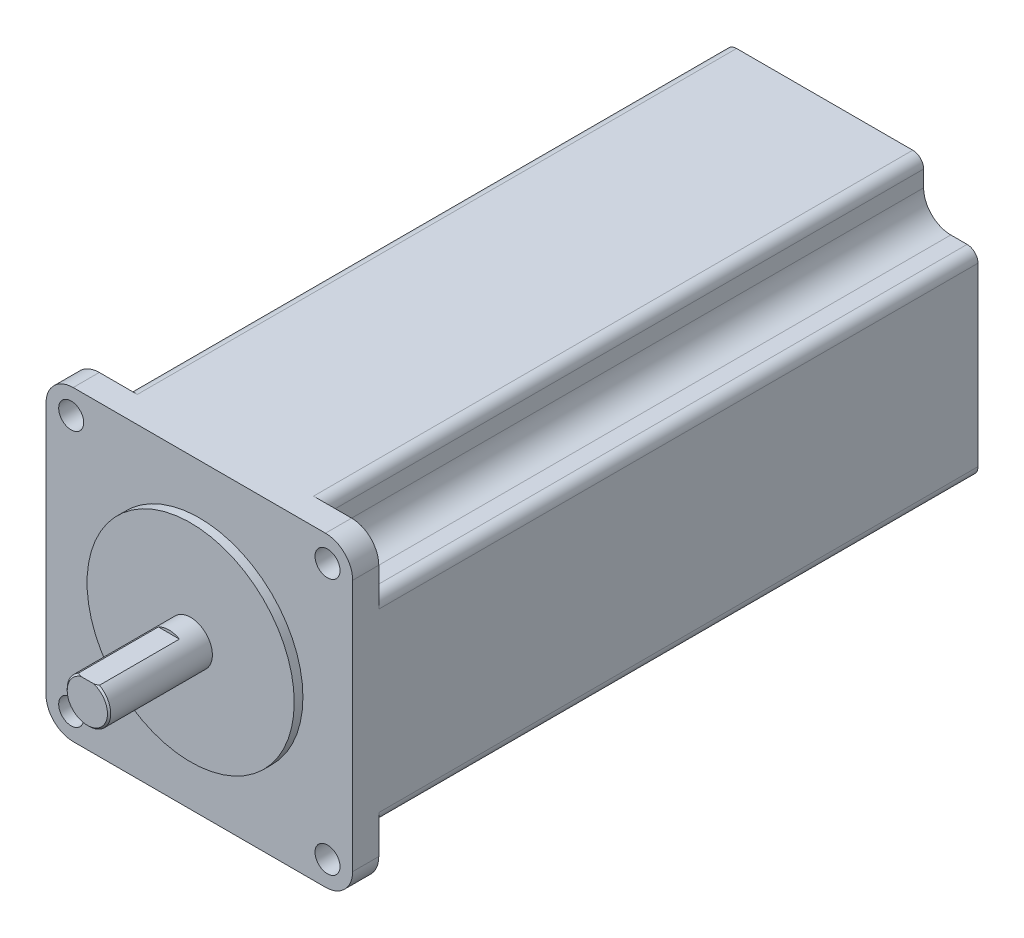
ISO-10303-21;
HEADER;
FILE_DESCRIPTION(('STEP AP214'),'2;1');
FILE_NAME('part.step','',(''),(''),'','','');
FILE_SCHEMA(('AUTOMOTIVE_DESIGN { 1 0 10303 214 1 1 1 1 }'));
ENDSEC;
DATA;
#1=APPLICATION_CONTEXT('core data for automotive mechanical design processes');
#2=APPLICATION_PROTOCOL_DEFINITION('international standard','automotive_design',2000,#1);
#3=PRODUCT_CONTEXT('',#1,'mechanical');
#4=PRODUCT('Part','Part','',(#3));
#5=PRODUCT_RELATED_PRODUCT_CATEGORY('part','',(#4));
#6=PRODUCT_DEFINITION_FORMATION('','',#4);
#7=PRODUCT_DEFINITION_CONTEXT('part definition',#1,'design');
#8=PRODUCT_DEFINITION('design','',#6,#7);
#9=PRODUCT_DEFINITION_SHAPE('','',#8);
#10=(LENGTH_UNIT() NAMED_UNIT(*) SI_UNIT(.MILLI.,.METRE.));
#11=(NAMED_UNIT(*) PLANE_ANGLE_UNIT() SI_UNIT($,.RADIAN.));
#12=(NAMED_UNIT(*) SI_UNIT($,.STERADIAN.) SOLID_ANGLE_UNIT());
#13=UNCERTAINTY_MEASURE_WITH_UNIT(LENGTH_MEASURE(1.E-05),#10,'distance_accuracy_value','');
#14=(GEOMETRIC_REPRESENTATION_CONTEXT(3) GLOBAL_UNCERTAINTY_ASSIGNED_CONTEXT((#13)) GLOBAL_UNIT_ASSIGNED_CONTEXT((#10,
#11,#12)) REPRESENTATION_CONTEXT('',''));
#15=CARTESIAN_POINT('',(0.,0.,0.));
#16=DIRECTION('',(0.,0.,1.));
#17=DIRECTION('',(1.,0.,0.));
#18=AXIS2_PLACEMENT_3D('',#15,#16,#17);
#19=CARTESIAN_POINT('',(23.2,-23.2,-116.6));
#20=DIRECTION('',(0.,0.,1.));
#21=DIRECTION('',(1.,0.,0.));
#22=AXIS2_PLACEMENT_3D('',#19,#20,#21);
#23=CYLINDRICAL_SURFACE('',#22,5.);
#24=CARTESIAN_POINT('',(23.2,-23.2,-6.4));
#25=DIRECTION('',(0.,0.,-1.));
#26=DIRECTION('',(-1.,0.,0.));
#27=AXIS2_PLACEMENT_3D('',#24,#25,#26);
#28=CIRCLE('',#27,5.);
#29=CARTESIAN_POINT('',(28.2,-23.2,-6.4));
#30=VERTEX_POINT('',#29);
#31=CARTESIAN_POINT('',(23.2,-28.2,-6.4));
#32=VERTEX_POINT('',#31);
#33=EDGE_CURVE('E335',#30,#32,#28,.T.);
#34=ORIENTED_EDGE('',*,*,#33,.F.);
#35=DIRECTION('',(0.,0.,1.));
#36=VECTOR('',#35,1.);
#37=CARTESIAN_POINT('',(28.2,-23.2,-116.6));
#38=LINE('',#37,#36);
#39=CARTESIAN_POINT('',(28.2,-23.2,-1.6));
#40=VERTEX_POINT('',#39);
#41=EDGE_CURVE('E502',#30,#40,#38,.T.);
#42=ORIENTED_EDGE('',*,*,#41,.T.);
#43=CARTESIAN_POINT('',(23.2,-23.2,-1.6));
#44=DIRECTION('',(0.,0.,-1.));
#45=DIRECTION('',(1.,0.,0.));
#46=AXIS2_PLACEMENT_3D('',#43,#44,#45);
#47=CIRCLE('',#46,5.);
#48=CARTESIAN_POINT('',(23.2,-28.2,-1.6));
#49=VERTEX_POINT('',#48);
#50=EDGE_CURVE('E492',#40,#49,#47,.T.);
#51=ORIENTED_EDGE('',*,*,#50,.T.);
#52=DIRECTION('',(0.,0.,1.));
#53=VECTOR('',#52,1.);
#54=CARTESIAN_POINT('',(23.2,-28.2,-116.6));
#55=LINE('',#54,#53);
#56=EDGE_CURVE('E538',#32,#49,#55,.T.);
#57=ORIENTED_EDGE('',*,*,#56,.F.);
#58=EDGE_LOOP('',(#34,#42,#51,#57));
#59=FACE_BOUND('',#58,.T.);
#60=ADVANCED_FACE('F35',(#59),#23,.T.);
#61=CARTESIAN_POINT('',(-23.2,-23.2,-116.6));
#62=DIRECTION('',(0.,0.,1.));
#63=DIRECTION('',(1.,0.,0.));
#64=AXIS2_PLACEMENT_3D('',#61,#62,#63);
#65=CYLINDRICAL_SURFACE('',#64,5.);
#66=CARTESIAN_POINT('',(-23.2,-23.2,-6.4));
#67=DIRECTION('',(0.,0.,-1.));
#68=DIRECTION('',(-1.,0.,0.));
#69=AXIS2_PLACEMENT_3D('',#66,#67,#68);
#70=CIRCLE('',#69,5.);
#71=CARTESIAN_POINT('',(-23.2,-28.2,-6.4));
#72=VERTEX_POINT('',#71);
#73=CARTESIAN_POINT('',(-28.2,-23.2,-6.4));
#74=VERTEX_POINT('',#73);
#75=EDGE_CURVE('E382',#72,#74,#70,.T.);
#76=ORIENTED_EDGE('',*,*,#75,.F.);
#77=DIRECTION('',(0.,0.,1.));
#78=VECTOR('',#77,1.);
#79=CARTESIAN_POINT('',(-23.2,-28.2,-116.6));
#80=LINE('',#79,#78);
#81=CARTESIAN_POINT('',(-23.2,-28.2,-1.6));
#82=VERTEX_POINT('',#81);
#83=EDGE_CURVE('E536',#72,#82,#80,.T.);
#84=ORIENTED_EDGE('',*,*,#83,.T.);
#85=CARTESIAN_POINT('',(-23.2,-23.2,-1.6));
#86=DIRECTION('',(0.,0.,-1.));
#87=DIRECTION('',(1.,0.,0.));
#88=AXIS2_PLACEMENT_3D('',#85,#86,#87);
#89=CIRCLE('',#88,5.);
#90=CARTESIAN_POINT('',(-28.2,-23.2,-1.6));
#91=VERTEX_POINT('',#90);
#92=EDGE_CURVE('E508',#82,#91,#89,.T.);
#93=ORIENTED_EDGE('',*,*,#92,.T.);
#94=DIRECTION('',(0.,0.,1.));
#95=VECTOR('',#94,1.);
#96=CARTESIAN_POINT('',(-28.2,-23.2,-116.6));
#97=LINE('',#96,#95);
#98=EDGE_CURVE('E534',#74,#91,#97,.T.);
#99=ORIENTED_EDGE('',*,*,#98,.F.);
#100=EDGE_LOOP('',(#76,#84,#93,#99));
#101=FACE_BOUND('',#100,.T.);
#102=ADVANCED_FACE('F586',(#101),#65,.T.);
#103=CARTESIAN_POINT('',(23.2,23.2,-116.6));
#104=DIRECTION('',(0.,0.,1.));
#105=DIRECTION('',(1.,0.,0.));
#106=AXIS2_PLACEMENT_3D('',#103,#104,#105);
#107=CYLINDRICAL_SURFACE('',#106,5.);
#108=CARTESIAN_POINT('',(23.2,23.2,-6.4));
#109=DIRECTION('',(0.,0.,-1.));
#110=DIRECTION('',(-1.,0.,0.));
#111=AXIS2_PLACEMENT_3D('',#108,#109,#110);
#112=CIRCLE('',#111,5.);
#113=CARTESIAN_POINT('',(23.2,28.2,-6.4));
#114=VERTEX_POINT('',#113);
#115=CARTESIAN_POINT('',(28.2,23.2,-6.4));
#116=VERTEX_POINT('',#115);
#117=EDGE_CURVE('E429',#114,#116,#112,.T.);
#118=ORIENTED_EDGE('',*,*,#117,.F.);
#119=DIRECTION('',(0.,0.,1.));
#120=VECTOR('',#119,1.);
#121=CARTESIAN_POINT('',(23.2,28.2,-116.6));
#122=LINE('',#121,#120);
#123=CARTESIAN_POINT('',(23.2,28.2,-1.6));
#124=VERTEX_POINT('',#123);
#125=EDGE_CURVE('E528',#114,#124,#122,.T.);
#126=ORIENTED_EDGE('',*,*,#125,.T.);
#127=CARTESIAN_POINT('',(23.2,23.2,-1.6));
#128=DIRECTION('',(0.,0.,-1.));
#129=DIRECTION('',(1.,0.,0.));
#130=AXIS2_PLACEMENT_3D('',#127,#128,#129);
#131=CIRCLE('',#130,5.);
#132=CARTESIAN_POINT('',(28.2,23.2,-1.6));
#133=VERTEX_POINT('',#132);
#134=EDGE_CURVE('E520',#124,#133,#131,.T.);
#135=ORIENTED_EDGE('',*,*,#134,.T.);
#136=DIRECTION('',(0.,0.,1.));
#137=VECTOR('',#136,1.);
#138=CARTESIAN_POINT('',(28.2,23.2,-116.6));
#139=LINE('',#138,#137);
#140=EDGE_CURVE('E526',#116,#133,#139,.T.);
#141=ORIENTED_EDGE('',*,*,#140,.F.);
#142=EDGE_LOOP('',(#118,#126,#135,#141));
#143=FACE_BOUND('',#142,.T.);
#144=ADVANCED_FACE('F591',(#143),#107,.T.);
#145=CARTESIAN_POINT('',(0.,0.,0.));
#146=DIRECTION('',(0.,0.,1.));
#147=DIRECTION('',(1.,0.,0.));
#148=AXIS2_PLACEMENT_3D('',#145,#146,#147);
#149=PLANE('',#148);
#150=CARTESIAN_POINT('',(0.,0.,0.));
#151=DIRECTION('',(0.,0.,1.));
#152=DIRECTION('',(1.,0.,0.));
#153=AXIS2_PLACEMENT_3D('',#150,#151,#152);
#154=CIRCLE('',#153,19.05);
#155=CARTESIAN_POINT('',(19.05,0.,0.));
#156=VERTEX_POINT('',#155);
#157=EDGE_CURVE('E546',#156,#156,#154,.T.);
#158=ORIENTED_EDGE('',*,*,#157,.T.);
#159=EDGE_LOOP('',(#158));
#160=FACE_BOUND('',#159,.T.);
#161=CARTESIAN_POINT('',(0.,0.,0.));
#162=DIRECTION('',(0.,0.,1.));
#163=DIRECTION('',(1.,0.,0.));
#164=AXIS2_PLACEMENT_3D('',#161,#162,#163);
#165=CIRCLE('',#164,4.);
#166=CARTESIAN_POINT('',(4.,0.,0.));
#167=VERTEX_POINT('',#166);
#168=EDGE_CURVE('E543',#167,#167,#165,.T.);
#169=ORIENTED_EDGE('',*,*,#168,.F.);
#170=EDGE_LOOP('',(#169));
#171=FACE_BOUND('',#170,.T.);
#172=ADVANCED_FACE('F610',(#160,#171),#149,.T.);
#173=CARTESIAN_POINT('',(0.,0.,-1.6));
#174=DIRECTION('',(0.,0.,1.));
#175=DIRECTION('',(1.,0.,0.));
#176=AXIS2_PLACEMENT_3D('',#173,#174,#175);
#177=CYLINDRICAL_SURFACE('',#176,19.05);
#178=CARTESIAN_POINT('',(0.,0.,-1.6));
#179=DIRECTION('',(0.,0.,1.));
#180=DIRECTION('',(1.,0.,0.));
#181=AXIS2_PLACEMENT_3D('',#178,#179,#180);
#182=CIRCLE('',#181,19.05);
#183=CARTESIAN_POINT('',(19.05,0.,-1.6));
#184=VERTEX_POINT('',#183);
#185=EDGE_CURVE('E540',#184,#184,#182,.F.);
#186=ORIENTED_EDGE('',*,*,#185,.F.);
#187=EDGE_LOOP('',(#186));
#188=FACE_BOUND('',#187,.T.);
#189=ORIENTED_EDGE('',*,*,#157,.F.);
#190=EDGE_LOOP('',(#189));
#191=FACE_BOUND('',#190,.T.);
#192=ADVANCED_FACE('F582',(#188,#191),#177,.T.);
#193=CARTESIAN_POINT('',(0.,0.,19.));
#194=DIRECTION('',(0.,0.,-1.));
#195=DIRECTION('',(-1.,0.,0.));
#196=AXIS2_PLACEMENT_3D('',#193,#194,#195);
#197=CYLINDRICAL_SURFACE('',#196,4.);
#198=CARTESIAN_POINT('',(0.,0.,18.7));
#199=DIRECTION('',(0.,0.,1.));
#200=DIRECTION('',(1.,0.,0.));
#201=AXIS2_PLACEMENT_3D('',#198,#199,#200);
#202=CIRCLE('',#201,4.);
#203=CARTESIAN_POINT('',(1.93649167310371,3.5,18.7));
#204=VERTEX_POINT('',#203);
#205=CARTESIAN_POINT('',(-1.93649167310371,3.5,18.7));
#206=VERTEX_POINT('',#205);
#207=EDGE_CURVE('E283',#204,#206,#202,.F.);
#208=ORIENTED_EDGE('',*,*,#207,.T.);
#209=DIRECTION('',(0.,0.,1.));
#210=VECTOR('',#209,1.);
#211=CARTESIAN_POINT('',(-1.93649167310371,3.5,4.));
#212=LINE('',#211,#210);
#213=CARTESIAN_POINT('',(-1.93649167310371,3.5,4.));
#214=VERTEX_POINT('',#213);
#215=EDGE_CURVE('E275',#214,#206,#212,.T.);
#216=ORIENTED_EDGE('',*,*,#215,.F.);
#217=CARTESIAN_POINT('',(0.,0.,4.));
#218=DIRECTION('',(0.,0.,1.));
#219=DIRECTION('',(1.,0.,0.));
#220=AXIS2_PLACEMENT_3D('',#217,#218,#219);
#221=CIRCLE('',#220,4.);
#222=CARTESIAN_POINT('',(1.93649167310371,3.5,4.));
#223=VERTEX_POINT('',#222);
#224=EDGE_CURVE('E266',#223,#214,#221,.T.);
#225=ORIENTED_EDGE('',*,*,#224,.F.);
#226=DIRECTION('',(0.,0.,1.));
#227=VECTOR('',#226,1.);
#228=CARTESIAN_POINT('',(1.93649167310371,3.5,4.));
#229=LINE('',#228,#227);
#230=EDGE_CURVE('E277',#223,#204,#229,.T.);
#231=ORIENTED_EDGE('',*,*,#230,.T.);
#232=EDGE_LOOP('',(#208,#216,#225,#231));
#233=FACE_BOUND('',#232,.T.);
#234=ORIENTED_EDGE('',*,*,#168,.T.);
#235=EDGE_LOOP('',(#234));
#236=FACE_BOUND('',#235,.T.);
#237=ADVANCED_FACE('F280',(#233,#236),#197,.T.);
#238=CARTESIAN_POINT('',(0.,0.,19.));
#239=DIRECTION('',(0.,0.,1.));
#240=DIRECTION('',(1.,0.,0.));
#241=AXIS2_PLACEMENT_3D('',#238,#239,#240);
#242=PLANE('',#241);
#243=DIRECTION('',(1.,0.,0.));
#244=VECTOR('',#243,1.);
#245=CARTESIAN_POINT('',(-1.93649167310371,3.5,19.));
#246=LINE('',#245,#244);
#247=CARTESIAN_POINT('',(-1.20000000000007,3.5,19.));
#248=VERTEX_POINT('',#247);
#249=CARTESIAN_POINT('',(1.20000000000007,3.5,19.));
#250=VERTEX_POINT('',#249);
#251=EDGE_CURVE('E54',#248,#250,#246,.T.);
#252=ORIENTED_EDGE('',*,*,#251,.F.);
#253=CARTESIAN_POINT('',(0.,0.,19.));
#254=DIRECTION('',(0.,0.,1.));
#255=DIRECTION('',(1.,0.,0.));
#256=AXIS2_PLACEMENT_3D('',#253,#254,#255);
#257=CIRCLE('',#256,3.70000000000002);
#258=EDGE_CURVE('E558',#248,#250,#257,.T.);
#259=ORIENTED_EDGE('',*,*,#258,.T.);
#260=EDGE_LOOP('',(#252,#259));
#261=FACE_BOUND('',#260,.T.);
#262=ADVANCED_FACE('F571',(#261),#242,.T.);
#263=CARTESIAN_POINT('',(-23.2,-28.2,-116.6));
#264=DIRECTION('',(0.,1.,0.));
#265=DIRECTION('',(-1.,0.,0.));
#266=AXIS2_PLACEMENT_3D('',#263,#264,#265);
#267=PLANE('',#266);
#268=DIRECTION('',(0.,0.,-1.));
#269=VECTOR('',#268,1.);
#270=CARTESIAN_POINT('',(-16.2,-28.2,-6.4));
#271=LINE('',#270,#269);
#272=CARTESIAN_POINT('',(-16.2,-28.2,-6.4));
#273=VERTEX_POINT('',#272);
#274=CARTESIAN_POINT('',(-16.2,-28.2,-116.6));
#275=VERTEX_POINT('',#274);
#276=EDGE_CURVE('E366',#273,#275,#271,.T.);
#277=ORIENTED_EDGE('',*,*,#276,.T.);
#278=DIRECTION('',(-1.,0.,0.));
#279=VECTOR('',#278,1.);
#280=CARTESIAN_POINT('',(-23.2,-28.2,-116.6));
#281=LINE('',#280,#279);
#282=CARTESIAN_POINT('',(16.2,-28.2,-116.6));
#283=VERTEX_POINT('',#282);
#284=EDGE_CURVE('E493',#283,#275,#281,.T.);
#285=ORIENTED_EDGE('',*,*,#284,.F.);
#286=DIRECTION('',(0.,0.,-1.));
#287=VECTOR('',#286,1.);
#288=CARTESIAN_POINT('',(16.2,-28.2,-6.4));
#289=LINE('',#288,#287);
#290=CARTESIAN_POINT('',(16.2,-28.2,-6.4));
#291=VERTEX_POINT('',#290);
#292=EDGE_CURVE('E338',#291,#283,#289,.T.);
#293=ORIENTED_EDGE('',*,*,#292,.F.);
#294=DIRECTION('',(-1.,0.,0.));
#295=VECTOR('',#294,1.);
#296=CARTESIAN_POINT('',(-23.2,-28.2,-6.4));
#297=LINE('',#296,#295);
#298=EDGE_CURVE('E347',#32,#291,#297,.T.);
#299=ORIENTED_EDGE('',*,*,#298,.F.);
#300=ORIENTED_EDGE('',*,*,#56,.T.);
#301=DIRECTION('',(-1.,0.,0.));
#302=VECTOR('',#301,1.);
#303=CARTESIAN_POINT('',(-23.2,-28.2,-1.6));
#304=LINE('',#303,#302);
#305=EDGE_CURVE('E505',#49,#82,#304,.T.);
#306=ORIENTED_EDGE('',*,*,#305,.T.);
#307=ORIENTED_EDGE('',*,*,#83,.F.);
#308=DIRECTION('',(-1.,0.,0.));
#309=VECTOR('',#308,1.);
#310=CARTESIAN_POINT('',(-23.2,-28.2,-6.4));
#311=LINE('',#310,#309);
#312=EDGE_CURVE('E394',#273,#72,#311,.T.);
#313=ORIENTED_EDGE('',*,*,#312,.F.);
#314=EDGE_LOOP('',(#277,#285,#293,#299,#300,#306,#307,#313));
#315=FACE_BOUND('',#314,.T.);
#316=ADVANCED_FACE('F573',(#315),#267,.F.);
#317=CARTESIAN_POINT('',(-28.2,23.2,-116.6));
#318=DIRECTION('',(1.,0.,0.));
#319=DIRECTION('',(0.,1.,0.));
#320=AXIS2_PLACEMENT_3D('',#317,#318,#319);
#321=PLANE('',#320);
#322=DIRECTION('',(0.,0.,-1.));
#323=VECTOR('',#322,1.);
#324=CARTESIAN_POINT('',(-28.2,16.2,-6.4));
#325=LINE('',#324,#323);
#326=CARTESIAN_POINT('',(-28.2,16.2,-6.4));
#327=VERTEX_POINT('',#326);
#328=CARTESIAN_POINT('',(-28.2,16.2,-116.6));
#329=VERTEX_POINT('',#328);
#330=EDGE_CURVE('E474',#327,#329,#325,.T.);
#331=ORIENTED_EDGE('',*,*,#330,.T.);
#332=DIRECTION('',(0.,1.,0.));
#333=VECTOR('',#332,1.);
#334=CARTESIAN_POINT('',(-28.2,23.2,-116.6));
#335=LINE('',#334,#333);
#336=CARTESIAN_POINT('',(-28.2,-16.2,-116.6));
#337=VERTEX_POINT('',#336);
#338=EDGE_CURVE('E495',#337,#329,#335,.T.);
#339=ORIENTED_EDGE('',*,*,#338,.F.);
#340=DIRECTION('',(0.,0.,-1.));
#341=VECTOR('',#340,1.);
#342=CARTESIAN_POINT('',(-28.2,-16.2,-6.4));
#343=LINE('',#342,#341);
#344=CARTESIAN_POINT('',(-28.2,-16.2,-6.4));
#345=VERTEX_POINT('',#344);
#346=EDGE_CURVE('E389',#345,#337,#343,.T.);
#347=ORIENTED_EDGE('',*,*,#346,.F.);
#348=DIRECTION('',(0.,1.,0.));
#349=VECTOR('',#348,1.);
#350=CARTESIAN_POINT('',(-28.2,23.2,-6.4));
#351=LINE('',#350,#349);
#352=EDGE_CURVE('E554',#74,#345,#351,.T.);
#353=ORIENTED_EDGE('',*,*,#352,.F.);
#354=ORIENTED_EDGE('',*,*,#98,.T.);
#355=DIRECTION('',(0.,1.,0.));
#356=VECTOR('',#355,1.);
#357=CARTESIAN_POINT('',(-28.2,23.2,-1.6));
#358=LINE('',#357,#356);
#359=CARTESIAN_POINT('',(-28.2,23.2,-1.6));
#360=VERTEX_POINT('',#359);
#361=EDGE_CURVE('E511',#91,#360,#358,.T.);
#362=ORIENTED_EDGE('',*,*,#361,.T.);
#363=DIRECTION('',(0.,0.,1.));
#364=VECTOR('',#363,1.);
#365=CARTESIAN_POINT('',(-28.2,23.2,-116.6));
#366=LINE('',#365,#364);
#367=CARTESIAN_POINT('',(-28.2,23.2,-6.4));
#368=VERTEX_POINT('',#367);
#369=EDGE_CURVE('E532',#368,#360,#366,.T.);
#370=ORIENTED_EDGE('',*,*,#369,.F.);
#371=DIRECTION('',(0.,-1.,0.));
#372=VECTOR('',#371,1.);
#373=CARTESIAN_POINT('',(-28.2,23.2,-6.4));
#374=LINE('',#373,#372);
#375=EDGE_CURVE('E489',#368,#327,#374,.T.);
#376=ORIENTED_EDGE('',*,*,#375,.T.);
#377=EDGE_LOOP('',(#331,#339,#347,#353,#354,#362,#370,#376));
#378=FACE_BOUND('',#377,.T.);
#379=ADVANCED_FACE('F579',(#378),#321,.F.);
#380=CARTESIAN_POINT('',(-23.2,23.2,-116.6));
#381=DIRECTION('',(0.,0.,1.));
#382=DIRECTION('',(1.,0.,0.));
#383=AXIS2_PLACEMENT_3D('',#380,#381,#382);
#384=CYLINDRICAL_SURFACE('',#383,5.);
#385=DIRECTION('',(0.,0.,1.));
#386=VECTOR('',#385,1.);
#387=CARTESIAN_POINT('',(-23.2,28.2,-116.6));
#388=LINE('',#387,#386);
#389=CARTESIAN_POINT('',(-23.2,28.2,-6.4));
#390=VERTEX_POINT('',#389);
#391=CARTESIAN_POINT('',(-23.2,28.2,-1.6));
#392=VERTEX_POINT('',#391);
#393=EDGE_CURVE('E530',#390,#392,#388,.T.);
#394=ORIENTED_EDGE('',*,*,#393,.F.);
#395=CARTESIAN_POINT('',(-23.2,23.2,-6.4));
#396=DIRECTION('',(0.,0.,1.));
#397=DIRECTION('',(1.,0.,0.));
#398=AXIS2_PLACEMENT_3D('',#395,#396,#397);
#399=CIRCLE('',#398,5.);
#400=EDGE_CURVE('E477',#390,#368,#399,.T.);
#401=ORIENTED_EDGE('',*,*,#400,.T.);
#402=ORIENTED_EDGE('',*,*,#369,.T.);
#403=CARTESIAN_POINT('',(-23.2,23.2,-1.6));
#404=DIRECTION('',(0.,0.,-1.));
#405=DIRECTION('',(1.,0.,0.));
#406=AXIS2_PLACEMENT_3D('',#403,#404,#405);
#407=CIRCLE('',#406,5.);
#408=EDGE_CURVE('E514',#360,#392,#407,.T.);
#409=ORIENTED_EDGE('',*,*,#408,.T.);
#410=EDGE_LOOP('',(#394,#401,#402,#409));
#411=FACE_BOUND('',#410,.T.);
#412=ADVANCED_FACE('F598',(#411),#384,.T.);
#413=CARTESIAN_POINT('',(23.2,28.2,-116.6));
#414=DIRECTION('',(0.,-1.,0.));
#415=DIRECTION('',(1.,0.,0.));
#416=AXIS2_PLACEMENT_3D('',#413,#414,#415);
#417=PLANE('',#416);
#418=DIRECTION('',(0.,0.,-1.));
#419=VECTOR('',#418,1.);
#420=CARTESIAN_POINT('',(16.2,28.2,-6.4));
#421=LINE('',#420,#419);
#422=CARTESIAN_POINT('',(16.2,28.2,-6.4));
#423=VERTEX_POINT('',#422);
#424=CARTESIAN_POINT('',(16.2,28.2,-116.6));
#425=VERTEX_POINT('',#424);
#426=EDGE_CURVE('E413',#423,#425,#421,.T.);
#427=ORIENTED_EDGE('',*,*,#426,.T.);
#428=DIRECTION('',(1.,0.,0.));
#429=VECTOR('',#428,1.);
#430=CARTESIAN_POINT('',(0.,28.2,-116.6));
#431=LINE('',#430,#429);
#432=CARTESIAN_POINT('',(-16.2,28.2,-116.6));
#433=VERTEX_POINT('',#432);
#434=EDGE_CURVE('E498',#433,#425,#431,.T.);
#435=ORIENTED_EDGE('',*,*,#434,.F.);
#436=DIRECTION('',(0.,0.,-1.));
#437=VECTOR('',#436,1.);
#438=CARTESIAN_POINT('',(-16.2,28.2,-6.4));
#439=LINE('',#438,#437);
#440=CARTESIAN_POINT('',(-16.2,28.2,-6.4));
#441=VERTEX_POINT('',#440);
#442=EDGE_CURVE('E460',#441,#433,#439,.T.);
#443=ORIENTED_EDGE('',*,*,#442,.F.);
#444=DIRECTION('',(-1.,0.,0.));
#445=VECTOR('',#444,1.);
#446=CARTESIAN_POINT('',(23.2,28.2,-6.4));
#447=LINE('',#446,#445);
#448=EDGE_CURVE('E549',#441,#390,#447,.T.);
#449=ORIENTED_EDGE('',*,*,#448,.T.);
#450=ORIENTED_EDGE('',*,*,#393,.T.);
#451=DIRECTION('',(1.,0.,0.));
#452=VECTOR('',#451,1.);
#453=CARTESIAN_POINT('',(23.2,28.2,-1.6));
#454=LINE('',#453,#452);
#455=EDGE_CURVE('E517',#392,#124,#454,.T.);
#456=ORIENTED_EDGE('',*,*,#455,.T.);
#457=ORIENTED_EDGE('',*,*,#125,.F.);
#458=DIRECTION('',(1.,0.,0.));
#459=VECTOR('',#458,1.);
#460=CARTESIAN_POINT('',(23.2,28.2,-6.4));
#461=LINE('',#460,#459);
#462=EDGE_CURVE('E441',#423,#114,#461,.T.);
#463=ORIENTED_EDGE('',*,*,#462,.F.);
#464=EDGE_LOOP('',(#427,#435,#443,#449,#450,#456,#457,#463));
#465=FACE_BOUND('',#464,.T.);
#466=ADVANCED_FACE('F602',(#465),#417,.F.);
#467=CARTESIAN_POINT('',(28.2,-23.2,-116.6));
#468=DIRECTION('',(-1.,0.,0.));
#469=DIRECTION('',(0.,0.,1.));
#470=AXIS2_PLACEMENT_3D('',#467,#468,#469);
#471=PLANE('',#470);
#472=DIRECTION('',(0.,0.,-1.));
#473=VECTOR('',#472,1.);
#474=CARTESIAN_POINT('',(28.2,-16.2,-6.4));
#475=LINE('',#474,#473);
#476=CARTESIAN_POINT('',(28.2,-16.2,-6.4));
#477=VERTEX_POINT('',#476);
#478=CARTESIAN_POINT('',(28.2,-16.2,-116.6));
#479=VERTEX_POINT('',#478);
#480=EDGE_CURVE('E340',#477,#479,#475,.T.);
#481=ORIENTED_EDGE('',*,*,#480,.T.);
#482=DIRECTION('',(0.,-1.,0.));
#483=VECTOR('',#482,1.);
#484=CARTESIAN_POINT('',(28.2,-23.2,-116.6));
#485=LINE('',#484,#483);
#486=CARTESIAN_POINT('',(28.2,16.2,-116.6));
#487=VERTEX_POINT('',#486);
#488=EDGE_CURVE('E500',#487,#479,#485,.T.);
#489=ORIENTED_EDGE('',*,*,#488,.F.);
#490=DIRECTION('',(0.,0.,-1.));
#491=VECTOR('',#490,1.);
#492=CARTESIAN_POINT('',(28.2,16.2,-6.4));
#493=LINE('',#492,#491);
#494=CARTESIAN_POINT('',(28.2,16.2,-6.4));
#495=VERTEX_POINT('',#494);
#496=EDGE_CURVE('E436',#495,#487,#493,.T.);
#497=ORIENTED_EDGE('',*,*,#496,.F.);
#498=DIRECTION('',(0.,-1.,0.));
#499=VECTOR('',#498,1.);
#500=CARTESIAN_POINT('',(28.2,-23.2,-6.4));
#501=LINE('',#500,#499);
#502=EDGE_CURVE('E552',#116,#495,#501,.T.);
#503=ORIENTED_EDGE('',*,*,#502,.F.);
#504=ORIENTED_EDGE('',*,*,#140,.T.);
#505=DIRECTION('',(0.,-1.,0.));
#506=VECTOR('',#505,1.);
#507=CARTESIAN_POINT('',(28.2,-23.2,-1.6));
#508=LINE('',#507,#506);
#509=EDGE_CURVE('E496',#133,#40,#508,.T.);
#510=ORIENTED_EDGE('',*,*,#509,.T.);
#511=ORIENTED_EDGE('',*,*,#41,.F.);
#512=DIRECTION('',(0.,-1.,0.));
#513=VECTOR('',#512,1.);
#514=CARTESIAN_POINT('',(28.2,-23.2,-6.4));
#515=LINE('',#514,#513);
#516=EDGE_CURVE('E556',#477,#30,#515,.T.);
#517=ORIENTED_EDGE('',*,*,#516,.F.);
#518=EDGE_LOOP('',(#481,#489,#497,#503,#504,#510,#511,#517));
#519=FACE_BOUND('',#518,.T.);
#520=ADVANCED_FACE('F606',(#519),#471,.F.);
#521=CARTESIAN_POINT('',(23.2,-23.2,-116.6));
#522=DIRECTION('',(0.,0.,1.));
#523=DIRECTION('',(1.,0.,0.));
#524=AXIS2_PLACEMENT_3D('',#521,#522,#523);
#525=PLANE('',#524);
#526=DIRECTION('',(0.,1.,0.));
#527=VECTOR('',#526,1.);
#528=CARTESIAN_POINT('',(18.2,-26.2,-116.6));
#529=LINE('',#528,#527);
#530=CARTESIAN_POINT('',(18.2,-26.2,-116.6));
#531=VERTEX_POINT('',#530);
#532=CARTESIAN_POINT('',(18.2,-23.2,-116.6));
#533=VERTEX_POINT('',#532);
#534=EDGE_CURVE('E308',#531,#533,#529,.T.);
#535=ORIENTED_EDGE('',*,*,#534,.F.);
#536=CARTESIAN_POINT('',(16.2,-26.2,-116.6));
#537=DIRECTION('',(0.,0.,1.));
#538=DIRECTION('',(1.,0.,0.));
#539=AXIS2_PLACEMENT_3D('',#536,#537,#538);
#540=CIRCLE('',#539,1.99999999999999);
#541=EDGE_CURVE('E328',#283,#531,#540,.T.);
#542=ORIENTED_EDGE('',*,*,#541,.F.);
#543=ORIENTED_EDGE('',*,*,#284,.T.);
#544=CARTESIAN_POINT('',(-16.2,-26.2,-116.6));
#545=DIRECTION('',(0.,0.,1.));
#546=DIRECTION('',(-1.,0.,0.));
#547=AXIS2_PLACEMENT_3D('',#544,#545,#546);
#548=CIRCLE('',#547,2.);
#549=CARTESIAN_POINT('',(-18.2,-26.2,-116.6));
#550=VERTEX_POINT('',#549);
#551=EDGE_CURVE('E349',#550,#275,#548,.T.);
#552=ORIENTED_EDGE('',*,*,#551,.F.);
#553=DIRECTION('',(0.,-1.,0.));
#554=VECTOR('',#553,1.);
#555=CARTESIAN_POINT('',(-18.2,-26.2,-116.6));
#556=LINE('',#555,#554);
#557=CARTESIAN_POINT('',(-18.2,-23.2,-116.6));
#558=VERTEX_POINT('',#557);
#559=EDGE_CURVE('E354',#558,#550,#556,.T.);
#560=ORIENTED_EDGE('',*,*,#559,.F.);
#561=CARTESIAN_POINT('',(-23.2,-23.2,-116.6));
#562=DIRECTION('',(0.,0.,-1.));
#563=DIRECTION('',(1.,0.,0.));
#564=AXIS2_PLACEMENT_3D('',#561,#562,#563);
#565=CIRCLE('',#564,5.);
#566=CARTESIAN_POINT('',(-23.2,-18.2,-116.6));
#567=VERTEX_POINT('',#566);
#568=EDGE_CURVE('E375',#567,#558,#565,.T.);
#569=ORIENTED_EDGE('',*,*,#568,.F.);
#570=DIRECTION('',(1.,0.,0.));
#571=VECTOR('',#570,1.);
#572=CARTESIAN_POINT('',(-23.2,-18.2,-116.6));
#573=LINE('',#572,#571);
#574=CARTESIAN_POINT('',(-26.2,-18.2,-116.6));
#575=VERTEX_POINT('',#574);
#576=EDGE_CURVE('E372',#575,#567,#573,.T.);
#577=ORIENTED_EDGE('',*,*,#576,.F.);
#578=CARTESIAN_POINT('',(-26.2,-16.2,-116.6));
#579=DIRECTION('',(0.,0.,1.));
#580=DIRECTION('',(-1.,0.,0.));
#581=AXIS2_PLACEMENT_3D('',#578,#579,#580);
#582=CIRCLE('',#581,2.);
#583=EDGE_CURVE('E369',#337,#575,#582,.T.);
#584=ORIENTED_EDGE('',*,*,#583,.F.);
#585=ORIENTED_EDGE('',*,*,#338,.T.);
#586=CARTESIAN_POINT('',(-26.2,16.2,-116.6));
#587=DIRECTION('',(0.,0.,1.));
#588=DIRECTION('',(1.,0.,0.));
#589=AXIS2_PLACEMENT_3D('',#586,#587,#588);
#590=CIRCLE('',#589,2.);
#591=CARTESIAN_POINT('',(-26.2,18.2,-116.6));
#592=VERTEX_POINT('',#591);
#593=EDGE_CURVE('E448',#592,#329,#590,.T.);
#594=ORIENTED_EDGE('',*,*,#593,.F.);
#595=DIRECTION('',(-1.,0.,0.));
#596=VECTOR('',#595,1.);
#597=CARTESIAN_POINT('',(-23.2,18.2,-116.6));
#598=LINE('',#597,#596);
#599=CARTESIAN_POINT('',(-23.2,18.2,-116.6));
#600=VERTEX_POINT('',#599);
#601=EDGE_CURVE('E469',#600,#592,#598,.T.);
#602=ORIENTED_EDGE('',*,*,#601,.F.);
#603=CARTESIAN_POINT('',(-23.2,23.2,-116.6));
#604=DIRECTION('',(0.,0.,-1.));
#605=DIRECTION('',(-1.,0.,0.));
#606=AXIS2_PLACEMENT_3D('',#603,#604,#605);
#607=CIRCLE('',#606,5.);
#608=CARTESIAN_POINT('',(-18.2,23.2,-116.6));
#609=VERTEX_POINT('',#608);
#610=EDGE_CURVE('E466',#609,#600,#607,.T.);
#611=ORIENTED_EDGE('',*,*,#610,.F.);
#612=DIRECTION('',(0.,-1.,0.));
#613=VECTOR('',#612,1.);
#614=CARTESIAN_POINT('',(-18.2,26.2,-116.6));
#615=LINE('',#614,#613);
#616=CARTESIAN_POINT('',(-18.2,26.2,-116.6));
#617=VERTEX_POINT('',#616);
#618=EDGE_CURVE('E463',#617,#609,#615,.T.);
#619=ORIENTED_EDGE('',*,*,#618,.F.);
#620=CARTESIAN_POINT('',(-16.2,26.2,-116.6));
#621=DIRECTION('',(0.,0.,1.));
#622=DIRECTION('',(1.,0.,0.));
#623=AXIS2_PLACEMENT_3D('',#620,#621,#622);
#624=CIRCLE('',#623,2.);
#625=EDGE_CURVE('E443',#433,#617,#624,.T.);
#626=ORIENTED_EDGE('',*,*,#625,.F.);
#627=ORIENTED_EDGE('',*,*,#434,.T.);
#628=CARTESIAN_POINT('',(16.2,26.2,-116.6));
#629=DIRECTION('',(0.,0.,1.));
#630=DIRECTION('',(-1.,0.,0.));
#631=AXIS2_PLACEMENT_3D('',#628,#629,#630);
#632=CIRCLE('',#631,1.99999999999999);
#633=CARTESIAN_POINT('',(18.2,26.2,-116.6));
#634=VERTEX_POINT('',#633);
#635=EDGE_CURVE('E396',#634,#425,#632,.T.);
#636=ORIENTED_EDGE('',*,*,#635,.F.);
#637=DIRECTION('',(0.,1.,0.));
#638=VECTOR('',#637,1.);
#639=CARTESIAN_POINT('',(18.2,26.2,-116.6));
#640=LINE('',#639,#638);
#641=CARTESIAN_POINT('',(18.2,23.2,-116.6));
#642=VERTEX_POINT('',#641);
#643=EDGE_CURVE('E401',#642,#634,#640,.T.);
#644=ORIENTED_EDGE('',*,*,#643,.F.);
#645=CARTESIAN_POINT('',(23.2,23.2,-116.6));
#646=DIRECTION('',(0.,0.,-1.));
#647=DIRECTION('',(1.,0.,0.));
#648=AXIS2_PLACEMENT_3D('',#645,#646,#647);
#649=CIRCLE('',#648,5.);
#650=CARTESIAN_POINT('',(23.2,18.2,-116.6));
#651=VERTEX_POINT('',#650);
#652=EDGE_CURVE('E422',#651,#642,#649,.T.);
#653=ORIENTED_EDGE('',*,*,#652,.F.);
#654=DIRECTION('',(-1.,0.,0.));
#655=VECTOR('',#654,1.);
#656=CARTESIAN_POINT('',(23.2,18.2,-116.6));
#657=LINE('',#656,#655);
#658=CARTESIAN_POINT('',(26.2,18.2,-116.6));
#659=VERTEX_POINT('',#658);
#660=EDGE_CURVE('E419',#659,#651,#657,.T.);
#661=ORIENTED_EDGE('',*,*,#660,.F.);
#662=CARTESIAN_POINT('',(26.2,16.2,-116.6));
#663=DIRECTION('',(0.,0.,1.));
#664=DIRECTION('',(-1.,0.,0.));
#665=AXIS2_PLACEMENT_3D('',#662,#663,#664);
#666=CIRCLE('',#665,2.);
#667=EDGE_CURVE('E416',#487,#659,#666,.T.);
#668=ORIENTED_EDGE('',*,*,#667,.F.);
#669=ORIENTED_EDGE('',*,*,#488,.T.);
#670=CARTESIAN_POINT('',(26.2,-16.2,-116.6));
#671=DIRECTION('',(0.,0.,1.));
#672=DIRECTION('',(1.,0.,0.));
#673=AXIS2_PLACEMENT_3D('',#670,#671,#672);
#674=CIRCLE('',#673,2.);
#675=CARTESIAN_POINT('',(26.2,-18.2,-116.6));
#676=VERTEX_POINT('',#675);
#677=EDGE_CURVE('E325',#676,#479,#674,.T.);
#678=ORIENTED_EDGE('',*,*,#677,.F.);
#679=DIRECTION('',(1.,0.,0.));
#680=VECTOR('',#679,1.);
#681=CARTESIAN_POINT('',(23.2,-18.2,-116.6));
#682=LINE('',#681,#680);
#683=CARTESIAN_POINT('',(23.2,-18.2,-116.6));
#684=VERTEX_POINT('',#683);
#685=EDGE_CURVE('E322',#684,#676,#682,.T.);
#686=ORIENTED_EDGE('',*,*,#685,.F.);
#687=CARTESIAN_POINT('',(23.2,-23.2,-116.6));
#688=DIRECTION('',(0.,0.,-1.));
#689=DIRECTION('',(-1.,0.,0.));
#690=AXIS2_PLACEMENT_3D('',#687,#688,#689);
#691=CIRCLE('',#690,5.);
#692=EDGE_CURVE('E62',#533,#684,#691,.T.);
#693=ORIENTED_EDGE('',*,*,#692,.F.);
#694=EDGE_LOOP('',(#535,#542,#543,#552,#560,#569,#577,#584,#585,#594,#602,#611,#619,#626,#627,
#636,#644,#653,#661,#668,#669,#678,#686,#693));
#695=FACE_BOUND('',#694,.T.);
#696=ADVANCED_FACE('F614',(#695),#525,.F.);
#697=CARTESIAN_POINT('',(23.2,-23.2,-1.6));
#698=DIRECTION('',(0.,0.,1.));
#699=DIRECTION('',(1.,0.,0.));
#700=AXIS2_PLACEMENT_3D('',#697,#698,#699);
#701=PLANE('',#700);
#702=CARTESIAN_POINT('',(-23.57,-23.57,-1.6));
#703=DIRECTION('',(0.,0.,1.));
#704=DIRECTION('',(1.,0.,0.));
#705=AXIS2_PLACEMENT_3D('',#702,#703,#704);
#706=CIRCLE('',#705,2.3);
#707=CARTESIAN_POINT('',(-21.27,-23.57,-1.6));
#708=VERTEX_POINT('',#707);
#709=EDGE_CURVE('E285',#708,#708,#706,.T.);
#710=ORIENTED_EDGE('',*,*,#709,.F.);
#711=EDGE_LOOP('',(#710));
#712=FACE_BOUND('',#711,.T.);
#713=CARTESIAN_POINT('',(23.57,-23.57,-1.6));
#714=DIRECTION('',(0.,0.,1.));
#715=DIRECTION('',(1.,0.,0.));
#716=AXIS2_PLACEMENT_3D('',#713,#714,#715);
#717=CIRCLE('',#716,2.3);
#718=CARTESIAN_POINT('',(25.87,-23.57,-1.6));
#719=VERTEX_POINT('',#718);
#720=EDGE_CURVE('E292',#719,#719,#717,.T.);
#721=ORIENTED_EDGE('',*,*,#720,.F.);
#722=EDGE_LOOP('',(#721));
#723=FACE_BOUND('',#722,.T.);
#724=CARTESIAN_POINT('',(23.57,23.57,-1.6));
#725=DIRECTION('',(0.,0.,1.));
#726=DIRECTION('',(1.,0.,0.));
#727=AXIS2_PLACEMENT_3D('',#724,#725,#726);
#728=CIRCLE('',#727,2.3);
#729=CARTESIAN_POINT('',(25.87,23.57,-1.6));
#730=VERTEX_POINT('',#729);
#731=EDGE_CURVE('E296',#730,#730,#728,.T.);
#732=ORIENTED_EDGE('',*,*,#731,.F.);
#733=EDGE_LOOP('',(#732));
#734=FACE_BOUND('',#733,.T.);
#735=CARTESIAN_POINT('',(-23.57,23.57,-1.6));
#736=DIRECTION('',(0.,0.,1.));
#737=DIRECTION('',(1.,0.,0.));
#738=AXIS2_PLACEMENT_3D('',#735,#736,#737);
#739=CIRCLE('',#738,2.3);
#740=CARTESIAN_POINT('',(-21.27,23.57,-1.6));
#741=VERTEX_POINT('',#740);
#742=EDGE_CURVE('E300',#741,#741,#739,.T.);
#743=ORIENTED_EDGE('',*,*,#742,.F.);
#744=EDGE_LOOP('',(#743));
#745=FACE_BOUND('',#744,.T.);
#746=ORIENTED_EDGE('',*,*,#185,.T.);
#747=EDGE_LOOP('',(#746));
#748=FACE_BOUND('',#747,.T.);
#749=ORIENTED_EDGE('',*,*,#50,.F.);
#750=ORIENTED_EDGE('',*,*,#509,.F.);
#751=ORIENTED_EDGE('',*,*,#134,.F.);
#752=ORIENTED_EDGE('',*,*,#455,.F.);
#753=ORIENTED_EDGE('',*,*,#408,.F.);
#754=ORIENTED_EDGE('',*,*,#361,.F.);
#755=ORIENTED_EDGE('',*,*,#92,.F.);
#756=ORIENTED_EDGE('',*,*,#305,.F.);
#757=EDGE_LOOP('',(#749,#750,#751,#752,#753,#754,#755,#756));
#758=FACE_BOUND('',#757,.T.);
#759=ADVANCED_FACE('F616',(#712,#723,#734,#745,#748,#758),#701,.T.);
#760=CARTESIAN_POINT('',(-16.2,26.2,-6.4));
#761=DIRECTION('',(0.,0.,1.));
#762=DIRECTION('',(1.,0.,0.));
#763=AXIS2_PLACEMENT_3D('',#760,#761,#762);
#764=PLANE('',#763);
#765=CARTESIAN_POINT('',(-23.57,23.57,-6.4));
#766=DIRECTION('',(0.,0.,1.));
#767=DIRECTION('',(1.,0.,0.));
#768=AXIS2_PLACEMENT_3D('',#765,#766,#767);
#769=CIRCLE('',#768,2.3);
#770=CARTESIAN_POINT('',(-21.27,23.57,-6.4));
#771=VERTEX_POINT('',#770);
#772=EDGE_CURVE('E303',#771,#771,#769,.T.);
#773=ORIENTED_EDGE('',*,*,#772,.T.);
#774=EDGE_LOOP('',(#773));
#775=FACE_BOUND('',#774,.T.);
#776=ORIENTED_EDGE('',*,*,#400,.F.);
#777=ORIENTED_EDGE('',*,*,#448,.F.);
#778=CARTESIAN_POINT('',(-16.2,26.2,-6.4));
#779=DIRECTION('',(0.,0.,1.));
#780=DIRECTION('',(1.,0.,0.));
#781=AXIS2_PLACEMENT_3D('',#778,#779,#780);
#782=CIRCLE('',#781,2.);
#783=CARTESIAN_POINT('',(-18.2,26.2,-6.4));
#784=VERTEX_POINT('',#783);
#785=EDGE_CURVE('E444',#441,#784,#782,.T.);
#786=ORIENTED_EDGE('',*,*,#785,.T.);
#787=DIRECTION('',(0.,-1.,0.));
#788=VECTOR('',#787,1.);
#789=CARTESIAN_POINT('',(-18.2,26.2,-6.4));
#790=LINE('',#789,#788);
#791=CARTESIAN_POINT('',(-18.2,23.2,-6.4));
#792=VERTEX_POINT('',#791);
#793=EDGE_CURVE('E447',#784,#792,#790,.T.);
#794=ORIENTED_EDGE('',*,*,#793,.T.);
#795=CARTESIAN_POINT('',(-23.2,23.2,-6.4));
#796=DIRECTION('',(0.,0.,-1.));
#797=DIRECTION('',(-1.,0.,0.));
#798=AXIS2_PLACEMENT_3D('',#795,#796,#797);
#799=CIRCLE('',#798,5.);
#800=CARTESIAN_POINT('',(-23.2,18.2,-6.4));
#801=VERTEX_POINT('',#800);
#802=EDGE_CURVE('E451',#792,#801,#799,.T.);
#803=ORIENTED_EDGE('',*,*,#802,.T.);
#804=DIRECTION('',(-1.,0.,0.));
#805=VECTOR('',#804,1.);
#806=CARTESIAN_POINT('',(-23.2,18.2,-6.4));
#807=LINE('',#806,#805);
#808=CARTESIAN_POINT('',(-26.2,18.2,-6.4));
#809=VERTEX_POINT('',#808);
#810=EDGE_CURVE('E454',#801,#809,#807,.T.);
#811=ORIENTED_EDGE('',*,*,#810,.T.);
#812=CARTESIAN_POINT('',(-26.2,16.2,-6.4));
#813=DIRECTION('',(0.,0.,1.));
#814=DIRECTION('',(1.,0.,0.));
#815=AXIS2_PLACEMENT_3D('',#812,#813,#814);
#816=CIRCLE('',#815,2.);
#817=EDGE_CURVE('E457',#809,#327,#816,.T.);
#818=ORIENTED_EDGE('',*,*,#817,.T.);
#819=ORIENTED_EDGE('',*,*,#375,.F.);
#820=EDGE_LOOP('',(#776,#777,#786,#794,#803,#811,#818,#819));
#821=FACE_BOUND('',#820,.T.);
#822=ADVANCED_FACE('F619',(#775,#821),#764,.F.);
#823=CARTESIAN_POINT('',(-26.2,16.2,-6.4));
#824=DIRECTION('',(0.,0.,-1.));
#825=DIRECTION('',(-1.,0.,0.));
#826=AXIS2_PLACEMENT_3D('',#823,#824,#825);
#827=CYLINDRICAL_SURFACE('',#826,2.);
#828=ORIENTED_EDGE('',*,*,#593,.T.);
#829=ORIENTED_EDGE('',*,*,#330,.F.);
#830=ORIENTED_EDGE('',*,*,#817,.F.);
#831=DIRECTION('',(0.,0.,-1.));
#832=VECTOR('',#831,1.);
#833=CARTESIAN_POINT('',(-26.2,18.2,-6.4));
#834=LINE('',#833,#832);
#835=EDGE_CURVE('E478',#809,#592,#834,.T.);
#836=ORIENTED_EDGE('',*,*,#835,.T.);
#837=EDGE_LOOP('',(#828,#829,#830,#836));
#838=FACE_BOUND('',#837,.T.);
#839=ADVANCED_FACE('F640',(#838),#827,.T.);
#840=CARTESIAN_POINT('',(-23.2,18.2,-6.4));
#841=DIRECTION('',(0.,-1.,0.));
#842=DIRECTION('',(0.,0.,-1.));
#843=AXIS2_PLACEMENT_3D('',#840,#841,#842);
#844=PLANE('',#843);
#845=ORIENTED_EDGE('',*,*,#601,.T.);
#846=ORIENTED_EDGE('',*,*,#835,.F.);
#847=ORIENTED_EDGE('',*,*,#810,.F.);
#848=DIRECTION('',(0.,0.,-1.));
#849=VECTOR('',#848,1.);
#850=CARTESIAN_POINT('',(-23.2,18.2,-6.4));
#851=LINE('',#850,#849);
#852=EDGE_CURVE('E480',#801,#600,#851,.T.);
#853=ORIENTED_EDGE('',*,*,#852,.T.);
#854=EDGE_LOOP('',(#845,#846,#847,#853));
#855=FACE_BOUND('',#854,.T.);
#856=ADVANCED_FACE('F636',(#855),#844,.F.);
#857=CARTESIAN_POINT('',(-23.2,23.2,-6.4));
#858=DIRECTION('',(0.,0.,-1.));
#859=DIRECTION('',(-1.,0.,0.));
#860=AXIS2_PLACEMENT_3D('',#857,#858,#859);
#861=CYLINDRICAL_SURFACE('',#860,5.);
#862=ORIENTED_EDGE('',*,*,#610,.T.);
#863=ORIENTED_EDGE('',*,*,#852,.F.);
#864=ORIENTED_EDGE('',*,*,#802,.F.);
#865=DIRECTION('',(0.,0.,-1.));
#866=VECTOR('',#865,1.);
#867=CARTESIAN_POINT('',(-18.2,23.2,-6.4));
#868=LINE('',#867,#866);
#869=EDGE_CURVE('E482',#792,#609,#868,.T.);
#870=ORIENTED_EDGE('',*,*,#869,.T.);
#871=EDGE_LOOP('',(#862,#863,#864,#870));
#872=FACE_BOUND('',#871,.T.);
#873=ADVANCED_FACE('F632',(#872),#861,.F.);
#874=CARTESIAN_POINT('',(-18.2,26.2,-6.4));
#875=DIRECTION('',(1.,0.,0.));
#876=DIRECTION('',(0.,0.,-1.));
#877=AXIS2_PLACEMENT_3D('',#874,#875,#876);
#878=PLANE('',#877);
#879=ORIENTED_EDGE('',*,*,#618,.T.);
#880=ORIENTED_EDGE('',*,*,#869,.F.);
#881=ORIENTED_EDGE('',*,*,#793,.F.);
#882=DIRECTION('',(0.,0.,-1.));
#883=VECTOR('',#882,1.);
#884=CARTESIAN_POINT('',(-18.2,26.2,-6.4));
#885=LINE('',#884,#883);
#886=EDGE_CURVE('E484',#784,#617,#885,.T.);
#887=ORIENTED_EDGE('',*,*,#886,.T.);
#888=EDGE_LOOP('',(#879,#880,#881,#887));
#889=FACE_BOUND('',#888,.T.);
#890=ADVANCED_FACE('F628',(#889),#878,.F.);
#891=CARTESIAN_POINT('',(-16.2,26.2,-6.4));
#892=DIRECTION('',(0.,0.,-1.));
#893=DIRECTION('',(-1.,0.,0.));
#894=AXIS2_PLACEMENT_3D('',#891,#892,#893);
#895=CYLINDRICAL_SURFACE('',#894,2.);
#896=ORIENTED_EDGE('',*,*,#625,.T.);
#897=ORIENTED_EDGE('',*,*,#886,.F.);
#898=ORIENTED_EDGE('',*,*,#785,.F.);
#899=ORIENTED_EDGE('',*,*,#442,.T.);
#900=EDGE_LOOP('',(#896,#897,#898,#899));
#901=FACE_BOUND('',#900,.T.);
#902=ADVANCED_FACE('F624',(#901),#895,.T.);
#903=CARTESIAN_POINT('',(16.2,26.2,-6.4));
#904=DIRECTION('',(0.,0.,-1.));
#905=DIRECTION('',(-1.,0.,0.));
#906=AXIS2_PLACEMENT_3D('',#903,#904,#905);
#907=PLANE('',#906);
#908=CARTESIAN_POINT('',(23.57,23.57,-6.4));
#909=DIRECTION('',(0.,0.,-1.));
#910=DIRECTION('',(-1.,0.,0.));
#911=AXIS2_PLACEMENT_3D('',#908,#909,#910);
#912=CIRCLE('',#911,2.3);
#913=CARTESIAN_POINT('',(21.27,23.57,-6.4));
#914=VERTEX_POINT('',#913);
#915=EDGE_CURVE('E299',#914,#914,#912,.T.);
#916=ORIENTED_EDGE('',*,*,#915,.F.);
#917=EDGE_LOOP('',(#916));
#918=FACE_BOUND('',#917,.T.);
#919=ORIENTED_EDGE('',*,*,#462,.T.);
#920=ORIENTED_EDGE('',*,*,#117,.T.);
#921=ORIENTED_EDGE('',*,*,#502,.T.);
#922=CARTESIAN_POINT('',(26.2,16.2,-6.4));
#923=DIRECTION('',(0.,0.,1.));
#924=DIRECTION('',(-1.,0.,0.));
#925=AXIS2_PLACEMENT_3D('',#922,#923,#924);
#926=CIRCLE('',#925,2.);
#927=CARTESIAN_POINT('',(26.2,18.2,-6.4));
#928=VERTEX_POINT('',#927);
#929=EDGE_CURVE('E400',#495,#928,#926,.T.);
#930=ORIENTED_EDGE('',*,*,#929,.T.);
#931=DIRECTION('',(-1.,0.,0.));
#932=VECTOR('',#931,1.);
#933=CARTESIAN_POINT('',(23.2,18.2,-6.4));
#934=LINE('',#933,#932);
#935=CARTESIAN_POINT('',(23.2,18.2,-6.4));
#936=VERTEX_POINT('',#935);
#937=EDGE_CURVE('E404',#928,#936,#934,.T.);
#938=ORIENTED_EDGE('',*,*,#937,.T.);
#939=CARTESIAN_POINT('',(23.2,23.2,-6.4));
#940=DIRECTION('',(0.,0.,-1.));
#941=DIRECTION('',(1.,0.,0.));
#942=AXIS2_PLACEMENT_3D('',#939,#940,#941);
#943=CIRCLE('',#942,5.);
#944=CARTESIAN_POINT('',(18.2,23.2,-6.4));
#945=VERTEX_POINT('',#944);
#946=EDGE_CURVE('E407',#936,#945,#943,.T.);
#947=ORIENTED_EDGE('',*,*,#946,.T.);
#948=DIRECTION('',(0.,1.,0.));
#949=VECTOR('',#948,1.);
#950=CARTESIAN_POINT('',(18.2,26.2,-6.4));
#951=LINE('',#950,#949);
#952=CARTESIAN_POINT('',(18.2,26.2,-6.4));
#953=VERTEX_POINT('',#952);
#954=EDGE_CURVE('E410',#945,#953,#951,.T.);
#955=ORIENTED_EDGE('',*,*,#954,.T.);
#956=CARTESIAN_POINT('',(16.2,26.2,-6.4));
#957=DIRECTION('',(0.,0.,1.));
#958=DIRECTION('',(-1.,0.,0.));
#959=AXIS2_PLACEMENT_3D('',#956,#957,#958);
#960=CIRCLE('',#959,1.99999999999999);
#961=EDGE_CURVE('E397',#953,#423,#960,.T.);
#962=ORIENTED_EDGE('',*,*,#961,.T.);
#963=EDGE_LOOP('',(#919,#920,#921,#930,#938,#947,#955,#962));
#964=FACE_BOUND('',#963,.T.);
#965=ADVANCED_FACE('F627',(#918,#964),#907,.T.);
#966=CARTESIAN_POINT('',(16.2,26.2,-6.4));
#967=DIRECTION('',(0.,0.,-1.));
#968=DIRECTION('',(-1.,0.,0.));
#969=AXIS2_PLACEMENT_3D('',#966,#967,#968);
#970=CYLINDRICAL_SURFACE('',#969,1.99999999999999);
#971=ORIENTED_EDGE('',*,*,#635,.T.);
#972=ORIENTED_EDGE('',*,*,#426,.F.);
#973=ORIENTED_EDGE('',*,*,#961,.F.);
#974=DIRECTION('',(0.,0.,-1.));
#975=VECTOR('',#974,1.);
#976=CARTESIAN_POINT('',(18.2,26.2,-6.4));
#977=LINE('',#976,#975);
#978=EDGE_CURVE('E427',#953,#634,#977,.T.);
#979=ORIENTED_EDGE('',*,*,#978,.T.);
#980=EDGE_LOOP('',(#971,#972,#973,#979));
#981=FACE_BOUND('',#980,.T.);
#982=ADVANCED_FACE('F648',(#981),#970,.T.);
#983=CARTESIAN_POINT('',(18.2,26.2,-6.4));
#984=DIRECTION('',(-1.,0.,0.));
#985=DIRECTION('',(0.,0.,1.));
#986=AXIS2_PLACEMENT_3D('',#983,#984,#985);
#987=PLANE('',#986);
#988=ORIENTED_EDGE('',*,*,#643,.T.);
#989=ORIENTED_EDGE('',*,*,#978,.F.);
#990=ORIENTED_EDGE('',*,*,#954,.F.);
#991=DIRECTION('',(0.,0.,-1.));
#992=VECTOR('',#991,1.);
#993=CARTESIAN_POINT('',(18.2,23.2,-6.4));
#994=LINE('',#993,#992);
#995=EDGE_CURVE('E430',#945,#642,#994,.T.);
#996=ORIENTED_EDGE('',*,*,#995,.T.);
#997=EDGE_LOOP('',(#988,#989,#990,#996));
#998=FACE_BOUND('',#997,.T.);
#999=ADVANCED_FACE('F651',(#998),#987,.F.);
#1000=CARTESIAN_POINT('',(23.2,23.2,-6.4));
#1001=DIRECTION('',(0.,0.,-1.));
#1002=DIRECTION('',(-1.,0.,0.));
#1003=AXIS2_PLACEMENT_3D('',#1000,#1001,#1002);
#1004=CYLINDRICAL_SURFACE('',#1003,5.);
#1005=ORIENTED_EDGE('',*,*,#652,.T.);
#1006=ORIENTED_EDGE('',*,*,#995,.F.);
#1007=ORIENTED_EDGE('',*,*,#946,.F.);
#1008=DIRECTION('',(0.,0.,-1.));
#1009=VECTOR('',#1008,1.);
#1010=CARTESIAN_POINT('',(23.2,18.2,-6.4));
#1011=LINE('',#1010,#1009);
#1012=EDGE_CURVE('E432',#936,#651,#1011,.T.);
#1013=ORIENTED_EDGE('',*,*,#1012,.T.);
#1014=EDGE_LOOP('',(#1005,#1006,#1007,#1013));
#1015=FACE_BOUND('',#1014,.T.);
#1016=ADVANCED_FACE('F661',(#1015),#1004,.F.);
#1017=CARTESIAN_POINT('',(23.2,18.2,-6.4));
#1018=DIRECTION('',(0.,-1.,0.));
#1019=DIRECTION('',(0.,0.,-1.));
#1020=AXIS2_PLACEMENT_3D('',#1017,#1018,#1019);
#1021=PLANE('',#1020);
#1022=ORIENTED_EDGE('',*,*,#660,.T.);
#1023=ORIENTED_EDGE('',*,*,#1012,.F.);
#1024=ORIENTED_EDGE('',*,*,#937,.F.);
#1025=DIRECTION('',(0.,0.,-1.));
#1026=VECTOR('',#1025,1.);
#1027=CARTESIAN_POINT('',(26.2,18.2,-6.4));
#1028=LINE('',#1027,#1026);
#1029=EDGE_CURVE('E434',#928,#659,#1028,.T.);
#1030=ORIENTED_EDGE('',*,*,#1029,.T.);
#1031=EDGE_LOOP('',(#1022,#1023,#1024,#1030));
#1032=FACE_BOUND('',#1031,.T.);
#1033=ADVANCED_FACE('F657',(#1032),#1021,.F.);
#1034=CARTESIAN_POINT('',(26.2,16.2,-6.4));
#1035=DIRECTION('',(0.,0.,-1.));
#1036=DIRECTION('',(-1.,0.,0.));
#1037=AXIS2_PLACEMENT_3D('',#1034,#1035,#1036);
#1038=CYLINDRICAL_SURFACE('',#1037,2.);
#1039=ORIENTED_EDGE('',*,*,#667,.T.);
#1040=ORIENTED_EDGE('',*,*,#1029,.F.);
#1041=ORIENTED_EDGE('',*,*,#929,.F.);
#1042=ORIENTED_EDGE('',*,*,#496,.T.);
#1043=EDGE_LOOP('',(#1039,#1040,#1041,#1042));
#1044=FACE_BOUND('',#1043,.T.);
#1045=ADVANCED_FACE('F653',(#1044),#1038,.T.);
#1046=CARTESIAN_POINT('',(-16.2,-26.2,-6.4));
#1047=DIRECTION('',(0.,0.,-1.));
#1048=DIRECTION('',(-1.,0.,0.));
#1049=AXIS2_PLACEMENT_3D('',#1046,#1047,#1048);
#1050=PLANE('',#1049);
#1051=CARTESIAN_POINT('',(-23.57,-23.57,-6.4));
#1052=DIRECTION('',(0.,0.,-1.));
#1053=DIRECTION('',(-1.,0.,0.));
#1054=AXIS2_PLACEMENT_3D('',#1051,#1052,#1053);
#1055=CIRCLE('',#1054,2.3);
#1056=CARTESIAN_POINT('',(-25.87,-23.57,-6.4));
#1057=VERTEX_POINT('',#1056);
#1058=EDGE_CURVE('E291',#1057,#1057,#1055,.T.);
#1059=ORIENTED_EDGE('',*,*,#1058,.F.);
#1060=EDGE_LOOP('',(#1059));
#1061=FACE_BOUND('',#1060,.T.);
#1062=ORIENTED_EDGE('',*,*,#312,.T.);
#1063=ORIENTED_EDGE('',*,*,#75,.T.);
#1064=ORIENTED_EDGE('',*,*,#352,.T.);
#1065=CARTESIAN_POINT('',(-26.2,-16.2,-6.4));
#1066=DIRECTION('',(0.,0.,1.));
#1067=DIRECTION('',(-1.,0.,0.));
#1068=AXIS2_PLACEMENT_3D('',#1065,#1066,#1067);
#1069=CIRCLE('',#1068,2.);
#1070=CARTESIAN_POINT('',(-26.2,-18.2,-6.4));
#1071=VERTEX_POINT('',#1070);
#1072=EDGE_CURVE('E353',#345,#1071,#1069,.T.);
#1073=ORIENTED_EDGE('',*,*,#1072,.T.);
#1074=DIRECTION('',(1.,0.,0.));
#1075=VECTOR('',#1074,1.);
#1076=CARTESIAN_POINT('',(-23.2,-18.2,-6.4));
#1077=LINE('',#1076,#1075);
#1078=CARTESIAN_POINT('',(-23.2,-18.2,-6.4));
#1079=VERTEX_POINT('',#1078);
#1080=EDGE_CURVE('E357',#1071,#1079,#1077,.T.);
#1081=ORIENTED_EDGE('',*,*,#1080,.T.);
#1082=CARTESIAN_POINT('',(-23.2,-23.2,-6.4));
#1083=DIRECTION('',(0.,0.,-1.));
#1084=DIRECTION('',(1.,0.,0.));
#1085=AXIS2_PLACEMENT_3D('',#1082,#1083,#1084);
#1086=CIRCLE('',#1085,5.);
#1087=CARTESIAN_POINT('',(-18.2,-23.2,-6.4));
#1088=VERTEX_POINT('',#1087);
#1089=EDGE_CURVE('E360',#1079,#1088,#1086,.T.);
#1090=ORIENTED_EDGE('',*,*,#1089,.T.);
#1091=DIRECTION('',(0.,-1.,0.));
#1092=VECTOR('',#1091,1.);
#1093=CARTESIAN_POINT('',(-18.2,-26.2,-6.4));
#1094=LINE('',#1093,#1092);
#1095=CARTESIAN_POINT('',(-18.2,-26.2,-6.4));
#1096=VERTEX_POINT('',#1095);
#1097=EDGE_CURVE('E363',#1088,#1096,#1094,.T.);
#1098=ORIENTED_EDGE('',*,*,#1097,.T.);
#1099=CARTESIAN_POINT('',(-16.2,-26.2,-6.4));
#1100=DIRECTION('',(0.,0.,1.));
#1101=DIRECTION('',(-1.,0.,0.));
#1102=AXIS2_PLACEMENT_3D('',#1099,#1100,#1101);
#1103=CIRCLE('',#1102,2.);
#1104=EDGE_CURVE('E350',#1096,#273,#1103,.T.);
#1105=ORIENTED_EDGE('',*,*,#1104,.T.);
#1106=EDGE_LOOP('',(#1062,#1063,#1064,#1073,#1081,#1090,#1098,#1105));
#1107=FACE_BOUND('',#1106,.T.);
#1108=ADVANCED_FACE('F656',(#1061,#1107),#1050,.T.);
#1109=CARTESIAN_POINT('',(-16.2,-26.2,-6.4));
#1110=DIRECTION('',(0.,0.,-1.));
#1111=DIRECTION('',(-1.,0.,0.));
#1112=AXIS2_PLACEMENT_3D('',#1109,#1110,#1111);
#1113=CYLINDRICAL_SURFACE('',#1112,2.);
#1114=ORIENTED_EDGE('',*,*,#551,.T.);
#1115=ORIENTED_EDGE('',*,*,#276,.F.);
#1116=ORIENTED_EDGE('',*,*,#1104,.F.);
#1117=DIRECTION('',(0.,0.,-1.));
#1118=VECTOR('',#1117,1.);
#1119=CARTESIAN_POINT('',(-18.2,-26.2,-6.4));
#1120=LINE('',#1119,#1118);
#1121=EDGE_CURVE('E380',#1096,#550,#1120,.T.);
#1122=ORIENTED_EDGE('',*,*,#1121,.T.);
#1123=EDGE_LOOP('',(#1114,#1115,#1116,#1122));
#1124=FACE_BOUND('',#1123,.T.);
#1125=ADVANCED_FACE('F672',(#1124),#1113,.T.);
#1126=CARTESIAN_POINT('',(-18.2,-26.2,-6.4));
#1127=DIRECTION('',(1.,0.,0.));
#1128=DIRECTION('',(0.,0.,-1.));
#1129=AXIS2_PLACEMENT_3D('',#1126,#1127,#1128);
#1130=PLANE('',#1129);
#1131=ORIENTED_EDGE('',*,*,#559,.T.);
#1132=ORIENTED_EDGE('',*,*,#1121,.F.);
#1133=ORIENTED_EDGE('',*,*,#1097,.F.);
#1134=DIRECTION('',(0.,0.,-1.));
#1135=VECTOR('',#1134,1.);
#1136=CARTESIAN_POINT('',(-18.2,-23.2,-6.4));
#1137=LINE('',#1136,#1135);
#1138=EDGE_CURVE('E383',#1088,#558,#1137,.T.);
#1139=ORIENTED_EDGE('',*,*,#1138,.T.);
#1140=EDGE_LOOP('',(#1131,#1132,#1133,#1139));
#1141=FACE_BOUND('',#1140,.T.);
#1142=ADVANCED_FACE('F675',(#1141),#1130,.F.);
#1143=CARTESIAN_POINT('',(-23.2,-23.2,-6.4));
#1144=DIRECTION('',(0.,0.,-1.));
#1145=DIRECTION('',(-1.,0.,0.));
#1146=AXIS2_PLACEMENT_3D('',#1143,#1144,#1145);
#1147=CYLINDRICAL_SURFACE('',#1146,5.);
#1148=ORIENTED_EDGE('',*,*,#568,.T.);
#1149=ORIENTED_EDGE('',*,*,#1138,.F.);
#1150=ORIENTED_EDGE('',*,*,#1089,.F.);
#1151=DIRECTION('',(0.,0.,-1.));
#1152=VECTOR('',#1151,1.);
#1153=CARTESIAN_POINT('',(-23.2,-18.2,-6.4));
#1154=LINE('',#1153,#1152);
#1155=EDGE_CURVE('E385',#1079,#567,#1154,.T.);
#1156=ORIENTED_EDGE('',*,*,#1155,.T.);
#1157=EDGE_LOOP('',(#1148,#1149,#1150,#1156));
#1158=FACE_BOUND('',#1157,.T.);
#1159=ADVANCED_FACE('F685',(#1158),#1147,.F.);
#1160=CARTESIAN_POINT('',(-23.2,-18.2,-6.4));
#1161=DIRECTION('',(0.,1.,0.));
#1162=DIRECTION('',(0.,0.,1.));
#1163=AXIS2_PLACEMENT_3D('',#1160,#1161,#1162);
#1164=PLANE('',#1163);
#1165=ORIENTED_EDGE('',*,*,#576,.T.);
#1166=ORIENTED_EDGE('',*,*,#1155,.F.);
#1167=ORIENTED_EDGE('',*,*,#1080,.F.);
#1168=DIRECTION('',(0.,0.,-1.));
#1169=VECTOR('',#1168,1.);
#1170=CARTESIAN_POINT('',(-26.2,-18.2,-6.4));
#1171=LINE('',#1170,#1169);
#1172=EDGE_CURVE('E387',#1071,#575,#1171,.T.);
#1173=ORIENTED_EDGE('',*,*,#1172,.T.);
#1174=EDGE_LOOP('',(#1165,#1166,#1167,#1173));
#1175=FACE_BOUND('',#1174,.T.);
#1176=ADVANCED_FACE('F681',(#1175),#1164,.F.);
#1177=CARTESIAN_POINT('',(-26.2,-16.2,-6.4));
#1178=DIRECTION('',(0.,0.,-1.));
#1179=DIRECTION('',(-1.,0.,0.));
#1180=AXIS2_PLACEMENT_3D('',#1177,#1178,#1179);
#1181=CYLINDRICAL_SURFACE('',#1180,2.);
#1182=ORIENTED_EDGE('',*,*,#583,.T.);
#1183=ORIENTED_EDGE('',*,*,#1172,.F.);
#1184=ORIENTED_EDGE('',*,*,#1072,.F.);
#1185=ORIENTED_EDGE('',*,*,#346,.T.);
#1186=EDGE_LOOP('',(#1182,#1183,#1184,#1185));
#1187=FACE_BOUND('',#1186,.T.);
#1188=ADVANCED_FACE('F677',(#1187),#1181,.T.);
#1189=CARTESIAN_POINT('',(23.2,-23.2,-6.4));
#1190=DIRECTION('',(0.,0.,-1.));
#1191=DIRECTION('',(-1.,0.,0.));
#1192=AXIS2_PLACEMENT_3D('',#1189,#1190,#1191);
#1193=PLANE('',#1192);
#1194=CARTESIAN_POINT('',(23.57,-23.57,-6.4));
#1195=DIRECTION('',(0.,0.,-1.));
#1196=DIRECTION('',(-1.,0.,0.));
#1197=AXIS2_PLACEMENT_3D('',#1194,#1195,#1196);
#1198=CIRCLE('',#1197,2.3);
#1199=CARTESIAN_POINT('',(21.27,-23.57,-6.4));
#1200=VERTEX_POINT('',#1199);
#1201=EDGE_CURVE('E295',#1200,#1200,#1198,.T.);
#1202=ORIENTED_EDGE('',*,*,#1201,.F.);
#1203=EDGE_LOOP('',(#1202));
#1204=FACE_BOUND('',#1203,.T.);
#1205=ORIENTED_EDGE('',*,*,#298,.T.);
#1206=CARTESIAN_POINT('',(16.2,-26.2,-6.4));
#1207=DIRECTION('',(0.,0.,1.));
#1208=DIRECTION('',(1.,0.,0.));
#1209=AXIS2_PLACEMENT_3D('',#1206,#1207,#1208);
#1210=CIRCLE('',#1209,1.99999999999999);
#1211=CARTESIAN_POINT('',(18.2,-26.2,-6.4));
#1212=VERTEX_POINT('',#1211);
#1213=EDGE_CURVE('E314',#291,#1212,#1210,.T.);
#1214=ORIENTED_EDGE('',*,*,#1213,.T.);
#1215=DIRECTION('',(0.,1.,0.));
#1216=VECTOR('',#1215,1.);
#1217=CARTESIAN_POINT('',(18.2,-26.2,-6.4));
#1218=LINE('',#1217,#1216);
#1219=CARTESIAN_POINT('',(18.2,-23.2,-6.4));
#1220=VERTEX_POINT('',#1219);
#1221=EDGE_CURVE('E317',#1212,#1220,#1218,.T.);
#1222=ORIENTED_EDGE('',*,*,#1221,.T.);
#1223=CARTESIAN_POINT('',(23.2,-23.2,-6.4));
#1224=DIRECTION('',(0.,0.,-1.));
#1225=DIRECTION('',(-1.,0.,0.));
#1226=AXIS2_PLACEMENT_3D('',#1223,#1224,#1225);
#1227=CIRCLE('',#1226,5.);
#1228=CARTESIAN_POINT('',(23.2,-18.2,-6.4));
#1229=VERTEX_POINT('',#1228);
#1230=EDGE_CURVE('E304',#1220,#1229,#1227,.T.);
#1231=ORIENTED_EDGE('',*,*,#1230,.T.);
#1232=DIRECTION('',(1.,0.,0.));
#1233=VECTOR('',#1232,1.);
#1234=CARTESIAN_POINT('',(23.2,-18.2,-6.4));
#1235=LINE('',#1234,#1233);
#1236=CARTESIAN_POINT('',(26.2,-18.2,-6.4));
#1237=VERTEX_POINT('',#1236);
#1238=EDGE_CURVE('E307',#1229,#1237,#1235,.T.);
#1239=ORIENTED_EDGE('',*,*,#1238,.T.);
#1240=CARTESIAN_POINT('',(26.2,-16.2,-6.4));
#1241=DIRECTION('',(0.,0.,1.));
#1242=DIRECTION('',(1.,0.,0.));
#1243=AXIS2_PLACEMENT_3D('',#1240,#1241,#1242);
#1244=CIRCLE('',#1243,2.);
#1245=EDGE_CURVE('E311',#1237,#477,#1244,.T.);
#1246=ORIENTED_EDGE('',*,*,#1245,.T.);
#1247=ORIENTED_EDGE('',*,*,#516,.T.);
#1248=ORIENTED_EDGE('',*,*,#33,.T.);
#1249=EDGE_LOOP('',(#1205,#1214,#1222,#1231,#1239,#1246,#1247,#1248));
#1250=FACE_BOUND('',#1249,.T.);
#1251=ADVANCED_FACE('F680',(#1204,#1250),#1193,.T.);
#1252=CARTESIAN_POINT('',(23.2,-23.2,-6.4));
#1253=DIRECTION('',(0.,0.,-1.));
#1254=DIRECTION('',(-1.,0.,0.));
#1255=AXIS2_PLACEMENT_3D('',#1252,#1253,#1254);
#1256=CYLINDRICAL_SURFACE('',#1255,5.);
#1257=ORIENTED_EDGE('',*,*,#692,.T.);
#1258=DIRECTION('',(0.,0.,-1.));
#1259=VECTOR('',#1258,1.);
#1260=CARTESIAN_POINT('',(23.2,-18.2,-6.4));
#1261=LINE('',#1260,#1259);
#1262=EDGE_CURVE('E320',#1229,#684,#1261,.T.);
#1263=ORIENTED_EDGE('',*,*,#1262,.F.);
#1264=ORIENTED_EDGE('',*,*,#1230,.F.);
#1265=DIRECTION('',(0.,0.,-1.));
#1266=VECTOR('',#1265,1.);
#1267=CARTESIAN_POINT('',(18.2,-23.2,-6.4));
#1268=LINE('',#1267,#1266);
#1269=EDGE_CURVE('E333',#1220,#533,#1268,.T.);
#1270=ORIENTED_EDGE('',*,*,#1269,.T.);
#1271=EDGE_LOOP('',(#1257,#1263,#1264,#1270));
#1272=FACE_BOUND('',#1271,.T.);
#1273=ADVANCED_FACE('F696',(#1272),#1256,.F.);
#1274=CARTESIAN_POINT('',(18.2,-26.2,-6.4));
#1275=DIRECTION('',(-1.,0.,0.));
#1276=DIRECTION('',(0.,0.,1.));
#1277=AXIS2_PLACEMENT_3D('',#1274,#1275,#1276);
#1278=PLANE('',#1277);
#1279=ORIENTED_EDGE('',*,*,#534,.T.);
#1280=ORIENTED_EDGE('',*,*,#1269,.F.);
#1281=ORIENTED_EDGE('',*,*,#1221,.F.);
#1282=DIRECTION('',(0.,0.,-1.));
#1283=VECTOR('',#1282,1.);
#1284=CARTESIAN_POINT('',(18.2,-26.2,-6.4));
#1285=LINE('',#1284,#1283);
#1286=EDGE_CURVE('E336',#1212,#531,#1285,.T.);
#1287=ORIENTED_EDGE('',*,*,#1286,.T.);
#1288=EDGE_LOOP('',(#1279,#1280,#1281,#1287));
#1289=FACE_BOUND('',#1288,.T.);
#1290=ADVANCED_FACE('F699',(#1289),#1278,.F.);
#1291=CARTESIAN_POINT('',(16.2,-26.2,-6.4));
#1292=DIRECTION('',(0.,0.,-1.));
#1293=DIRECTION('',(-1.,0.,0.));
#1294=AXIS2_PLACEMENT_3D('',#1291,#1292,#1293);
#1295=CYLINDRICAL_SURFACE('',#1294,1.99999999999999);
#1296=ORIENTED_EDGE('',*,*,#541,.T.);
#1297=ORIENTED_EDGE('',*,*,#1286,.F.);
#1298=ORIENTED_EDGE('',*,*,#1213,.F.);
#1299=ORIENTED_EDGE('',*,*,#292,.T.);
#1300=EDGE_LOOP('',(#1296,#1297,#1298,#1299));
#1301=FACE_BOUND('',#1300,.T.);
#1302=ADVANCED_FACE('F708',(#1301),#1295,.T.);
#1303=CARTESIAN_POINT('',(26.2,-16.2,-6.4));
#1304=DIRECTION('',(0.,0.,-1.));
#1305=DIRECTION('',(-1.,0.,0.));
#1306=AXIS2_PLACEMENT_3D('',#1303,#1304,#1305);
#1307=CYLINDRICAL_SURFACE('',#1306,2.);
#1308=ORIENTED_EDGE('',*,*,#677,.T.);
#1309=ORIENTED_EDGE('',*,*,#480,.F.);
#1310=ORIENTED_EDGE('',*,*,#1245,.F.);
#1311=DIRECTION('',(0.,0.,-1.));
#1312=VECTOR('',#1311,1.);
#1313=CARTESIAN_POINT('',(26.2,-18.2,-6.4));
#1314=LINE('',#1313,#1312);
#1315=EDGE_CURVE('E343',#1237,#676,#1314,.T.);
#1316=ORIENTED_EDGE('',*,*,#1315,.T.);
#1317=EDGE_LOOP('',(#1308,#1309,#1310,#1316));
#1318=FACE_BOUND('',#1317,.T.);
#1319=ADVANCED_FACE('F704',(#1318),#1307,.T.);
#1320=CARTESIAN_POINT('',(23.2,-18.2,-6.4));
#1321=DIRECTION('',(0.,1.,0.));
#1322=DIRECTION('',(0.,0.,1.));
#1323=AXIS2_PLACEMENT_3D('',#1320,#1321,#1322);
#1324=PLANE('',#1323);
#1325=ORIENTED_EDGE('',*,*,#685,.T.);
#1326=ORIENTED_EDGE('',*,*,#1315,.F.);
#1327=ORIENTED_EDGE('',*,*,#1238,.F.);
#1328=ORIENTED_EDGE('',*,*,#1262,.T.);
#1329=EDGE_LOOP('',(#1325,#1326,#1327,#1328));
#1330=FACE_BOUND('',#1329,.T.);
#1331=ADVANCED_FACE('F700',(#1330),#1324,.F.);
#1332=CARTESIAN_POINT('',(-23.57,23.57,-51.3));
#1333=DIRECTION('',(0.,0.,1.));
#1334=DIRECTION('',(1.,0.,0.));
#1335=AXIS2_PLACEMENT_3D('',#1332,#1333,#1334);
#1336=CYLINDRICAL_SURFACE('',#1335,2.3);
#1337=ORIENTED_EDGE('',*,*,#742,.T.);
#1338=EDGE_LOOP('',(#1337));
#1339=FACE_BOUND('',#1338,.T.);
#1340=ORIENTED_EDGE('',*,*,#772,.F.);
#1341=EDGE_LOOP('',(#1340));
#1342=FACE_BOUND('',#1341,.T.);
#1343=ADVANCED_FACE('F703',(#1339,#1342),#1336,.F.);
#1344=CARTESIAN_POINT('',(23.57,23.57,-51.3));
#1345=DIRECTION('',(0.,0.,1.));
#1346=DIRECTION('',(1.,0.,0.));
#1347=AXIS2_PLACEMENT_3D('',#1344,#1345,#1346);
#1348=CYLINDRICAL_SURFACE('',#1347,2.3);
#1349=ORIENTED_EDGE('',*,*,#915,.T.);
#1350=EDGE_LOOP('',(#1349));
#1351=FACE_BOUND('',#1350,.T.);
#1352=ORIENTED_EDGE('',*,*,#731,.T.);
#1353=EDGE_LOOP('',(#1352));
#1354=FACE_BOUND('',#1353,.T.);
#1355=ADVANCED_FACE('F721',(#1351,#1354),#1348,.F.);
#1356=CARTESIAN_POINT('',(23.57,-23.57,-51.3));
#1357=DIRECTION('',(0.,0.,1.));
#1358=DIRECTION('',(1.,0.,0.));
#1359=AXIS2_PLACEMENT_3D('',#1356,#1357,#1358);
#1360=CYLINDRICAL_SURFACE('',#1359,2.3);
#1361=ORIENTED_EDGE('',*,*,#1201,.T.);
#1362=EDGE_LOOP('',(#1361));
#1363=FACE_BOUND('',#1362,.T.);
#1364=ORIENTED_EDGE('',*,*,#720,.T.);
#1365=EDGE_LOOP('',(#1364));
#1366=FACE_BOUND('',#1365,.T.);
#1367=ADVANCED_FACE('F725',(#1363,#1366),#1360,.F.);
#1368=CARTESIAN_POINT('',(-23.57,-23.57,-51.3));
#1369=DIRECTION('',(0.,0.,1.));
#1370=DIRECTION('',(1.,0.,0.));
#1371=AXIS2_PLACEMENT_3D('',#1368,#1369,#1370);
#1372=CYLINDRICAL_SURFACE('',#1371,2.3);
#1373=ORIENTED_EDGE('',*,*,#1058,.T.);
#1374=EDGE_LOOP('',(#1373));
#1375=FACE_BOUND('',#1374,.T.);
#1376=ORIENTED_EDGE('',*,*,#709,.T.);
#1377=EDGE_LOOP('',(#1376));
#1378=FACE_BOUND('',#1377,.T.);
#1379=ADVANCED_FACE('F729',(#1375,#1378),#1372,.F.);
#1380=CARTESIAN_POINT('',(0.,0.,19.));
#1381=DIRECTION('',(0.,0.,-1.));
#1382=DIRECTION('',(-1.,0.,0.));
#1383=AXIS2_PLACEMENT_3D('',#1380,#1381,#1382);
#1384=CONICAL_SURFACE('',#1383,3.70000000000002,0.78539816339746);
#1385=CARTESIAN_POINT('',(-4.26744262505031,3.5,17.1808454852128));
#1386=CARTESIAN_POINT('',(-4.16410372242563,3.5,17.2607296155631));
#1387=CARTESIAN_POINT('',(-4.06021159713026,3.5,17.3399093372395));
#1388=CARTESIAN_POINT('',(-3.85109154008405,3.5,17.4965345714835));
#1389=CARTESIAN_POINT('',(-3.74586330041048,3.5,17.5739796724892));
#1390=CARTESIAN_POINT('',(-3.53305975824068,3.5,17.7273708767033));
#1391=CARTESIAN_POINT('',(-3.42547252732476,3.5,17.8033004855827));
#1392=CARTESIAN_POINT('',(-3.20850661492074,3.5,17.9525469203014));
#1393=CARTESIAN_POINT('',(-3.09912805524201,3.5,18.0258639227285));
#1394=CARTESIAN_POINT('',(-2.87062032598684,3.5,18.1742523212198));
#1395=CARTESIAN_POINT('',(-2.75134070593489,3.5,18.2490932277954));
#1396=CARTESIAN_POINT('',(-2.5099449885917,3.5,18.3941307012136));
#1397=CARTESIAN_POINT('',(-2.38782840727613,3.5,18.4643264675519));
#1398=CARTESIAN_POINT('',(-2.14070292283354,3.5,18.5985519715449));
#1399=CARTESIAN_POINT('',(-2.01570386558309,3.5,18.6625996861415));
#1400=CARTESIAN_POINT('',(-1.7621015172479,3.5,18.7830421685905));
#1401=CARTESIAN_POINT('',(-1.63349997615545,3.5,18.83944057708));
#1402=CARTESIAN_POINT('',(-1.37715932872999,3.5,18.9405824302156));
#1403=CARTESIAN_POINT('',(-1.24956045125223,3.5,18.9856764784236));
#1404=CARTESIAN_POINT('',(-0.990848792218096,3.5,19.0645321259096));
#1405=CARTESIAN_POINT('',(-0.859736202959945,3.5,19.0982943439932));
#1406=CARTESIAN_POINT('',(-0.597703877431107,3.5,19.1515922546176));
#1407=CARTESIAN_POINT('',(-0.466847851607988,3.5,19.1714346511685));
#1408=CARTESIAN_POINT('',(-0.203735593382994,3.5,19.1965185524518));
#1409=CARTESIAN_POINT('',(-0.0714796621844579,3.5,19.2017631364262));
#1410=CARTESIAN_POINT('',(0.193400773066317,3.5,19.1971752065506));
#1411=CARTESIAN_POINT('',(0.326023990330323,3.5,19.1872700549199));
#1412=CARTESIAN_POINT('',(0.589401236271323,3.5,19.1531263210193));
#1413=CARTESIAN_POINT('',(0.720154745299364,3.5,19.1288838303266));
#1414=CARTESIAN_POINT('',(0.981667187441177,3.5,19.0672152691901));
#1415=CARTESIAN_POINT('',(1.11235547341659,3.5,19.0294956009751));
#1416=CARTESIAN_POINT('',(1.37009536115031,3.5,18.9433540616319));
#1417=CARTESIAN_POINT('',(1.4971468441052,3.5,18.8949318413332));
#1418=CARTESIAN_POINT('',(1.74660400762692,3.5,18.790023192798));
#1419=CARTESIAN_POINT('',(1.86903920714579,3.5,18.7336060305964));
#1420=CARTESIAN_POINT('',(2.11067621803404,3.5,18.6141809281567));
#1421=CARTESIAN_POINT('',(2.22987681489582,3.5,18.5511705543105));
#1422=CARTESIAN_POINT('',(2.46564567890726,3.5,18.4198359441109));
#1423=CARTESIAN_POINT('',(2.58220738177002,3.5,18.3515000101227));
#1424=CARTESIAN_POINT('',(2.81282538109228,3.5,18.2107186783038));
#1425=CARTESIAN_POINT('',(2.92688140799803,3.5,18.138272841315));
#1426=CARTESIAN_POINT('',(3.14561069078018,3.5,17.9948436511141));
#1427=CARTESIAN_POINT('',(3.25041752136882,3.5,17.9240630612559));
#1428=CARTESIAN_POINT('',(3.45840697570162,3.5,17.7801478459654));
#1429=CARTESIAN_POINT('',(3.56158950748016,3.5,17.707013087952));
#1430=CARTESIAN_POINT('',(3.76590863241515,3.5,17.5592694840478));
#1431=CARTESIAN_POINT('',(3.86705398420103,3.5,17.4846727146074));
#1432=CARTESIAN_POINT('',(4.06811786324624,3.5,17.3338835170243));
#1433=CARTESIAN_POINT('',(4.1680366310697,3.5,17.2576914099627));
#1434=CARTESIAN_POINT('',(4.26744262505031,3.5,17.1808454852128));
#1435=B_SPLINE_CURVE_WITH_KNOTS('',3,(#1385,#1386,#1387,#1388,#1389,#1390,#1391,#1392,#1393,
#1394,#1395,#1396,#1397,#1398,#1399,#1400,#1401,#1402,#1403,#1404,#1405,#1406,#1407,#1408,#1409,
#1410,#1411,#1412,#1413,#1414,#1415,#1416,#1417,#1418,#1419,#1420,#1421,#1422,#1423,#1424,#1425,
#1426,#1427,#1428,#1429,#1430,#1431,#1432,#1433,#1434),.UNSPECIFIED.,.F.,.F.,(4,2,2,2,2,2,2,2,2,
2,2,2,2,2,2,2,2,2,2,2,2,2,2,2,4),(0.,0.391853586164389,0.783799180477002,1.17881502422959,
1.57380411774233,1.99616430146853,2.41859708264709,2.83975442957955,3.26071062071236,
3.66628324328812,4.07183371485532,4.46814114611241,4.86436497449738,5.2624945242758,
5.66073265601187,6.06823590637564,6.47575245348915,6.87993271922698,7.28426270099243,
7.68950728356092,8.09479524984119,8.47416429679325,8.85355474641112,9.23057296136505,
9.60751601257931),.UNSPECIFIED.);
#1436=EDGE_CURVE('E11',#206,#248,#1435,.T.);
#1437=ORIENTED_EDGE('',*,*,#1436,.F.);
#1438=ORIENTED_EDGE('',*,*,#207,.F.);
#1439=EDGE_CURVE('E40',#250,#204,#1435,.T.);
#1440=ORIENTED_EDGE('',*,*,#1439,.F.);
#1441=ORIENTED_EDGE('',*,*,#258,.F.);
#1442=EDGE_LOOP('',(#1437,#1438,#1440,#1441));
#1443=FACE_BOUND('',#1442,.T.);
#1444=ADVANCED_FACE('F37',(#1443),#1384,.T.);
#1445=CARTESIAN_POINT('',(-1.93649167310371,3.5,4.));
#1446=DIRECTION('',(0.,-1.,0.));
#1447=DIRECTION('',(1.,0.,0.));
#1448=AXIS2_PLACEMENT_3D('',#1445,#1446,#1447);
#1449=PLANE('',#1448);
#1450=ORIENTED_EDGE('',*,*,#1436,.T.);
#1451=ORIENTED_EDGE('',*,*,#251,.T.);
#1452=ORIENTED_EDGE('',*,*,#1439,.T.);
#1453=ORIENTED_EDGE('',*,*,#230,.F.);
#1454=DIRECTION('',(1.,0.,0.));
#1455=VECTOR('',#1454,1.);
#1456=CARTESIAN_POINT('',(-1.93649167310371,3.5,4.));
#1457=LINE('',#1456,#1455);
#1458=EDGE_CURVE('E269',#214,#223,#1457,.T.);
#1459=ORIENTED_EDGE('',*,*,#1458,.F.);
#1460=ORIENTED_EDGE('',*,*,#215,.T.);
#1461=EDGE_LOOP('',(#1450,#1451,#1452,#1453,#1459,#1460));
#1462=FACE_BOUND('',#1461,.T.);
#1463=ADVANCED_FACE('F274',(#1462),#1449,.F.);
#1464=CARTESIAN_POINT('',(0.,0.,4.));
#1465=DIRECTION('',(0.,0.,1.));
#1466=DIRECTION('',(1.,0.,0.));
#1467=AXIS2_PLACEMENT_3D('',#1464,#1465,#1466);
#1468=PLANE('',#1467);
#1469=ORIENTED_EDGE('',*,*,#224,.T.);
#1470=ORIENTED_EDGE('',*,*,#1458,.T.);
#1471=EDGE_LOOP('',(#1469,#1470));
#1472=FACE_BOUND('',#1471,.T.);
#1473=ADVANCED_FACE('F268',(#1472),#1468,.T.);
#1474=CLOSED_SHELL('',(#60,#102,#144,#172,#192,#237,#262,#316,#379,#412,#466,#520,#696,#759,
#822,#839,#856,#873,#890,#902,#965,#982,#999,#1016,#1033,#1045,#1108,#1125,#1142,#1159,#1176,
#1188,#1251,#1273,#1290,#1302,#1319,#1331,#1343,#1355,#1367,#1379,#1444,#1463,#1473));
#1475=MANIFOLD_SOLID_BREP('B2',#1474);
#1476=ADVANCED_BREP_SHAPE_REPRESENTATION('',(#18,#1475),#14);
#1477=SHAPE_DEFINITION_REPRESENTATION(#9,#1476);
ENDSEC;
END-ISO-10303-21;
